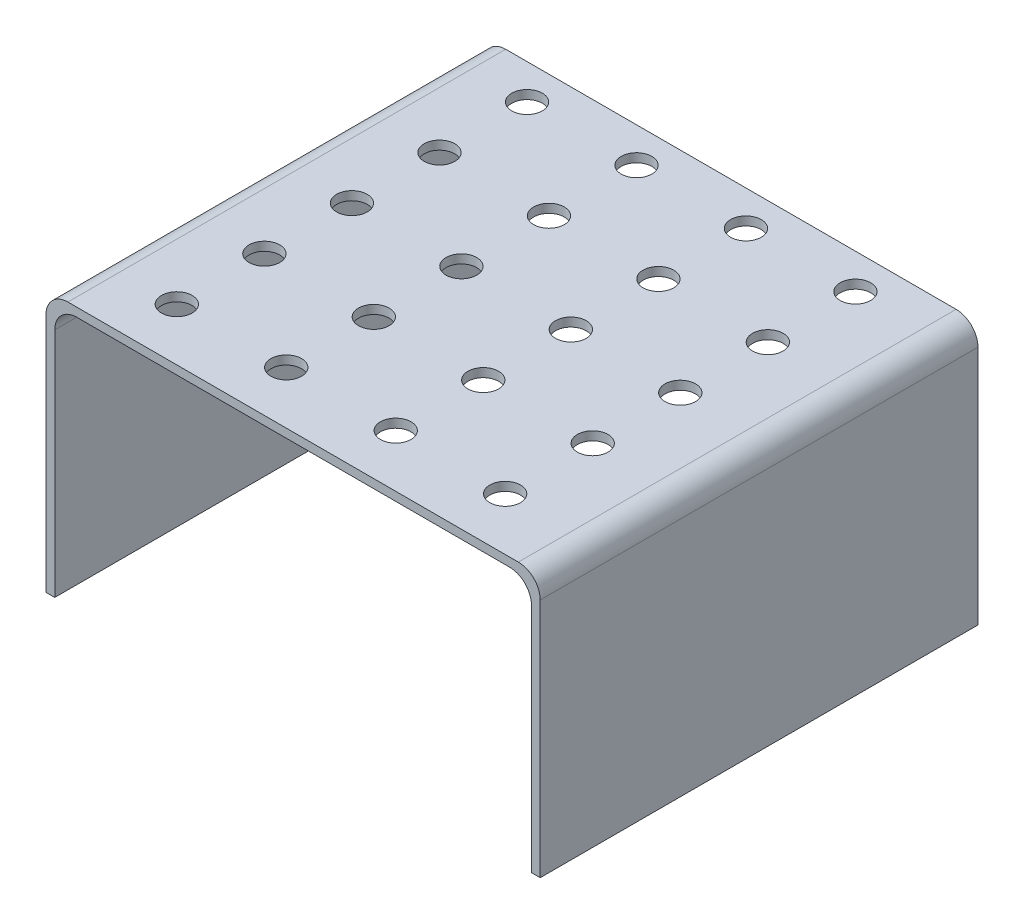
ISO-10303-21;
HEADER;
FILE_DESCRIPTION(('STEP AP214'),'2;1');
FILE_NAME('part.step','',(''),(''),'','','');
FILE_SCHEMA(('AUTOMOTIVE_DESIGN { 1 0 10303 214 1 1 1 1 }'));
ENDSEC;
DATA;
#1=APPLICATION_CONTEXT('core data for automotive mechanical design processes');
#2=APPLICATION_PROTOCOL_DEFINITION('international standard','automotive_design',2000,#1);
#3=PRODUCT_CONTEXT('',#1,'mechanical');
#4=PRODUCT('Part','Part','',(#3));
#5=PRODUCT_RELATED_PRODUCT_CATEGORY('part','',(#4));
#6=PRODUCT_DEFINITION_FORMATION('','',#4);
#7=PRODUCT_DEFINITION_CONTEXT('part definition',#1,'design');
#8=PRODUCT_DEFINITION('design','',#6,#7);
#9=PRODUCT_DEFINITION_SHAPE('','',#8);
#10=(LENGTH_UNIT() NAMED_UNIT(*) SI_UNIT(.MILLI.,.METRE.));
#11=(NAMED_UNIT(*) PLANE_ANGLE_UNIT() SI_UNIT($,.RADIAN.));
#12=(NAMED_UNIT(*) SI_UNIT($,.STERADIAN.) SOLID_ANGLE_UNIT());
#13=UNCERTAINTY_MEASURE_WITH_UNIT(LENGTH_MEASURE(1.E-05),#10,'distance_accuracy_value','');
#14=(GEOMETRIC_REPRESENTATION_CONTEXT(3) GLOBAL_UNCERTAINTY_ASSIGNED_CONTEXT((#13)) GLOBAL_UNIT_ASSIGNED_CONTEXT((#10,
#11,#12)) REPRESENTATION_CONTEXT('',''));
#15=CARTESIAN_POINT('',(0.,0.,0.));
#16=DIRECTION('',(0.,0.,1.));
#17=DIRECTION('',(1.,0.,0.));
#18=AXIS2_PLACEMENT_3D('',#15,#16,#17);
#19=CARTESIAN_POINT('',(-42.3555368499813,29.5386457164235,100.));
#20=DIRECTION('',(1.,0.,0.));
#21=DIRECTION('',(0.,0.,-1.));
#22=AXIS2_PLACEMENT_3D('',#19,#20,#21);
#23=PLANE('',#22);
#24=DIRECTION('',(0.,-1.,0.));
#25=VECTOR('',#24,1.);
#26=CARTESIAN_POINT('',(-42.3555368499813,29.5386457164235,100.));
#27=LINE('',#26,#25);
#28=CARTESIAN_POINT('',(-42.3555368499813,24.5386457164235,100.));
#29=VERTEX_POINT('',#28);
#30=CARTESIAN_POINT('',(-42.3555368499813,-30.4024130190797,100.));
#31=VERTEX_POINT('',#30);
#32=EDGE_CURVE('E417',#29,#31,#27,.T.);
#33=ORIENTED_EDGE('',*,*,#32,.F.);
#34=DIRECTION('',(0.,0.,-1.));
#35=VECTOR('',#34,1.);
#36=CARTESIAN_POINT('',(-42.3555368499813,24.5386457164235,100.));
#37=LINE('',#36,#35);
#38=CARTESIAN_POINT('',(-42.3555368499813,24.5386457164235,0.));
#39=VERTEX_POINT('',#38);
#40=EDGE_CURVE('E125',#29,#39,#37,.T.);
#41=ORIENTED_EDGE('',*,*,#40,.T.);
#42=DIRECTION('',(0.,-1.,0.));
#43=VECTOR('',#42,1.);
#44=CARTESIAN_POINT('',(-42.3555368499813,29.5386457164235,0.));
#45=LINE('',#44,#43);
#46=CARTESIAN_POINT('',(-42.3555368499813,-30.4024130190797,0.));
#47=VERTEX_POINT('',#46);
#48=EDGE_CURVE('E120',#39,#47,#45,.T.);
#49=ORIENTED_EDGE('',*,*,#48,.T.);
#50=DIRECTION('',(0.,0.,-1.));
#51=VECTOR('',#50,1.);
#52=CARTESIAN_POINT('',(-42.3555368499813,-30.4024130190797,100.));
#53=LINE('',#52,#51);
#54=EDGE_CURVE('E123',#31,#47,#53,.T.);
#55=ORIENTED_EDGE('',*,*,#54,.F.);
#56=EDGE_LOOP('',(#33,#41,#49,#55));
#57=FACE_BOUND('',#56,.T.);
#58=ADVANCED_FACE('F27',(#57),#23,.F.);
#59=CARTESIAN_POINT('',(-42.3555368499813,-30.4024130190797,100.));
#60=DIRECTION('',(0.,1.,0.));
#61=DIRECTION('',(0.,0.,1.));
#62=AXIS2_PLACEMENT_3D('',#59,#60,#61);
#63=PLANE('',#62);
#64=DIRECTION('',(1.,0.,0.));
#65=VECTOR('',#64,1.);
#66=CARTESIAN_POINT('',(-42.3555368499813,-30.4024130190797,0.));
#67=LINE('',#66,#65);
#68=CARTESIAN_POINT('',(-40.3555368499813,-30.4024130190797,0.));
#69=VERTEX_POINT('',#68);
#70=EDGE_CURVE('E127',#47,#69,#67,.T.);
#71=ORIENTED_EDGE('',*,*,#70,.T.);
#72=DIRECTION('',(0.,0.,-1.));
#73=VECTOR('',#72,1.);
#74=CARTESIAN_POINT('',(-40.3555368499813,-30.4024130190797,100.));
#75=LINE('',#74,#73);
#76=CARTESIAN_POINT('',(-40.3555368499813,-30.4024130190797,100.));
#77=VERTEX_POINT('',#76);
#78=EDGE_CURVE('E143',#77,#69,#75,.T.);
#79=ORIENTED_EDGE('',*,*,#78,.F.);
#80=DIRECTION('',(1.,0.,0.));
#81=VECTOR('',#80,1.);
#82=CARTESIAN_POINT('',(-42.3555368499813,-30.4024130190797,100.));
#83=LINE('',#82,#81);
#84=EDGE_CURVE('E141',#31,#77,#83,.T.);
#85=ORIENTED_EDGE('',*,*,#84,.F.);
#86=ORIENTED_EDGE('',*,*,#54,.T.);
#87=EDGE_LOOP('',(#71,#79,#85,#86));
#88=FACE_BOUND('',#87,.T.);
#89=ADVANCED_FACE('F140',(#88),#63,.F.);
#90=CARTESIAN_POINT('',(-40.3555368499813,-30.4024130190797,100.));
#91=DIRECTION('',(-1.,0.,0.));
#92=DIRECTION('',(0.,0.,1.));
#93=AXIS2_PLACEMENT_3D('',#90,#91,#92);
#94=PLANE('',#93);
#95=DIRECTION('',(0.,1.,0.));
#96=VECTOR('',#95,1.);
#97=CARTESIAN_POINT('',(-40.3555368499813,-30.4024130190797,0.));
#98=LINE('',#97,#96);
#99=CARTESIAN_POINT('',(-40.3555368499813,22.5386457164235,0.));
#100=VERTEX_POINT('',#99);
#101=EDGE_CURVE('E134',#69,#100,#98,.T.);
#102=ORIENTED_EDGE('',*,*,#101,.T.);
#103=DIRECTION('',(0.,0.,-1.));
#104=VECTOR('',#103,1.);
#105=CARTESIAN_POINT('',(-40.3555368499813,22.5386457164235,100.));
#106=LINE('',#105,#104);
#107=CARTESIAN_POINT('',(-40.3555368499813,22.5386457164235,100.));
#108=VERTEX_POINT('',#107);
#109=EDGE_CURVE('E156',#100,#108,#106,.F.);
#110=ORIENTED_EDGE('',*,*,#109,.T.);
#111=DIRECTION('',(0.,1.,0.));
#112=VECTOR('',#111,1.);
#113=CARTESIAN_POINT('',(-40.3555368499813,-30.4024130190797,100.));
#114=LINE('',#113,#112);
#115=EDGE_CURVE('E423',#77,#108,#114,.T.);
#116=ORIENTED_EDGE('',*,*,#115,.F.);
#117=ORIENTED_EDGE('',*,*,#78,.T.);
#118=EDGE_LOOP('',(#102,#110,#116,#117));
#119=FACE_BOUND('',#118,.T.);
#120=ADVANCED_FACE('F304',(#119),#94,.F.);
#121=CARTESIAN_POINT('',(-40.3555368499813,27.5386457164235,100.));
#122=DIRECTION('',(0.,1.,0.));
#123=DIRECTION('',(0.,0.,1.));
#124=AXIS2_PLACEMENT_3D('',#121,#122,#123);
#125=PLANE('',#124);
#126=CARTESIAN_POINT('',(25.5225589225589,27.5386457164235,88.));
#127=DIRECTION('',(0.,1.,0.));
#128=DIRECTION('',(0.,0.,1.));
#129=AXIS2_PLACEMENT_3D('',#126,#127,#128);
#130=CIRCLE('',#129,3.5);
#131=CARTESIAN_POINT('',(25.5225589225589,27.5386457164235,91.5));
#132=VERTEX_POINT('',#131);
#133=EDGE_CURVE('E570',#132,#132,#130,.T.);
#134=ORIENTED_EDGE('',*,*,#133,.T.);
#135=EDGE_LOOP('',(#134));
#136=FACE_BOUND('',#135,.T.);
#137=CARTESIAN_POINT('',(25.5225589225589,27.5386457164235,68.));
#138=DIRECTION('',(0.,1.,0.));
#139=DIRECTION('',(0.,0.,1.));
#140=AXIS2_PLACEMENT_3D('',#137,#138,#139);
#141=CIRCLE('',#140,3.5);
#142=CARTESIAN_POINT('',(25.5225589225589,27.5386457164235,71.5));
#143=VERTEX_POINT('',#142);
#144=EDGE_CURVE('E574',#143,#143,#141,.T.);
#145=ORIENTED_EDGE('',*,*,#144,.T.);
#146=EDGE_LOOP('',(#145));
#147=FACE_BOUND('',#146,.T.);
#148=CARTESIAN_POINT('',(50.5225589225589,27.5386457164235,88.));
#149=DIRECTION('',(0.,1.,0.));
#150=DIRECTION('',(0.,0.,1.));
#151=AXIS2_PLACEMENT_3D('',#148,#149,#150);
#152=CIRCLE('',#151,3.5);
#153=CARTESIAN_POINT('',(50.5225589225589,27.5386457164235,91.5));
#154=VERTEX_POINT('',#153);
#155=EDGE_CURVE('E128',#154,#154,#152,.T.);
#156=ORIENTED_EDGE('',*,*,#155,.T.);
#157=EDGE_LOOP('',(#156));
#158=FACE_BOUND('',#157,.T.);
#159=DIRECTION('',(1.,0.,0.));
#160=VECTOR('',#159,1.);
#161=CARTESIAN_POINT('',(-40.3555368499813,27.5386457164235,0.));
#162=LINE('',#161,#160);
#163=CARTESIAN_POINT('',(-35.3555368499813,27.5386457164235,0.));
#164=VERTEX_POINT('',#163);
#165=CARTESIAN_POINT('',(63.5225589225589,27.5386457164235,0.));
#166=VERTEX_POINT('',#165);
#167=EDGE_CURVE('E586',#164,#166,#162,.T.);
#168=ORIENTED_EDGE('',*,*,#167,.T.);
#169=DIRECTION('',(0.,0.,-1.));
#170=VECTOR('',#169,1.);
#171=CARTESIAN_POINT('',(63.5225589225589,27.5386457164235,100.));
#172=LINE('',#171,#170);
#173=CARTESIAN_POINT('',(63.5225589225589,27.5386457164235,100.));
#174=VERTEX_POINT('',#173);
#175=EDGE_CURVE('E154',#166,#174,#172,.F.);
#176=ORIENTED_EDGE('',*,*,#175,.T.);
#177=DIRECTION('',(1.,0.,0.));
#178=VECTOR('',#177,1.);
#179=CARTESIAN_POINT('',(-40.3555368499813,27.5386457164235,100.));
#180=LINE('',#179,#178);
#181=CARTESIAN_POINT('',(-35.3555368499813,27.5386457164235,100.));
#182=VERTEX_POINT('',#181);
#183=EDGE_CURVE('E426',#182,#174,#180,.T.);
#184=ORIENTED_EDGE('',*,*,#183,.F.);
#185=DIRECTION('',(0.,0.,-1.));
#186=VECTOR('',#185,1.);
#187=CARTESIAN_POINT('',(-35.3555368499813,27.5386457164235,0.));
#188=LINE('',#187,#186);
#189=EDGE_CURVE('E146',#182,#164,#188,.T.);
#190=ORIENTED_EDGE('',*,*,#189,.T.);
#191=EDGE_LOOP('',(#168,#176,#184,#190));
#192=FACE_BOUND('',#191,.T.);
#193=CARTESIAN_POINT('',(0.522558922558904,27.5386457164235,68.));
#194=DIRECTION('',(0.,1.,0.));
#195=DIRECTION('',(0.,0.,1.));
#196=AXIS2_PLACEMENT_3D('',#193,#194,#195);
#197=CIRCLE('',#196,3.5);
#198=CARTESIAN_POINT('',(0.522558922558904,27.5386457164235,71.5));
#199=VERTEX_POINT('',#198);
#200=EDGE_CURVE('E183',#199,#199,#197,.T.);
#201=ORIENTED_EDGE('',*,*,#200,.T.);
#202=EDGE_LOOP('',(#201));
#203=FACE_BOUND('',#202,.T.);
#204=CARTESIAN_POINT('',(25.5225589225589,27.5386457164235,48.));
#205=DIRECTION('',(0.,1.,0.));
#206=DIRECTION('',(0.,0.,1.));
#207=AXIS2_PLACEMENT_3D('',#204,#205,#206);
#208=CIRCLE('',#207,3.5);
#209=CARTESIAN_POINT('',(25.5225589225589,27.5386457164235,51.5));
#210=VERTEX_POINT('',#209);
#211=EDGE_CURVE('E189',#210,#210,#208,.T.);
#212=ORIENTED_EDGE('',*,*,#211,.T.);
#213=EDGE_LOOP('',(#212));
#214=FACE_BOUND('',#213,.T.);
#215=CARTESIAN_POINT('',(0.522558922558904,27.5386457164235,48.));
#216=DIRECTION('',(0.,1.,0.));
#217=DIRECTION('',(0.,0.,1.));
#218=AXIS2_PLACEMENT_3D('',#215,#216,#217);
#219=CIRCLE('',#218,3.5);
#220=CARTESIAN_POINT('',(0.522558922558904,27.5386457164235,51.5));
#221=VERTEX_POINT('',#220);
#222=EDGE_CURVE('E195',#221,#221,#219,.T.);
#223=ORIENTED_EDGE('',*,*,#222,.T.);
#224=EDGE_LOOP('',(#223));
#225=FACE_BOUND('',#224,.T.);
#226=CARTESIAN_POINT('',(25.5225589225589,27.5386457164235,28.));
#227=DIRECTION('',(0.,1.,0.));
#228=DIRECTION('',(0.,0.,1.));
#229=AXIS2_PLACEMENT_3D('',#226,#227,#228);
#230=CIRCLE('',#229,3.5);
#231=CARTESIAN_POINT('',(25.5225589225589,27.5386457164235,31.5));
#232=VERTEX_POINT('',#231);
#233=EDGE_CURVE('E201',#232,#232,#230,.T.);
#234=ORIENTED_EDGE('',*,*,#233,.T.);
#235=EDGE_LOOP('',(#234));
#236=FACE_BOUND('',#235,.T.);
#237=CARTESIAN_POINT('',(0.522558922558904,27.5386457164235,28.));
#238=DIRECTION('',(0.,1.,0.));
#239=DIRECTION('',(0.,0.,1.));
#240=AXIS2_PLACEMENT_3D('',#237,#238,#239);
#241=CIRCLE('',#240,3.5);
#242=CARTESIAN_POINT('',(0.522558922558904,27.5386457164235,31.5));
#243=VERTEX_POINT('',#242);
#244=EDGE_CURVE('E207',#243,#243,#241,.T.);
#245=ORIENTED_EDGE('',*,*,#244,.T.);
#246=EDGE_LOOP('',(#245));
#247=FACE_BOUND('',#246,.T.);
#248=CARTESIAN_POINT('',(0.522558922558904,27.5386457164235,88.));
#249=DIRECTION('',(0.,1.,0.));
#250=DIRECTION('',(0.,0.,1.));
#251=AXIS2_PLACEMENT_3D('',#248,#249,#250);
#252=CIRCLE('',#251,3.5);
#253=CARTESIAN_POINT('',(0.522558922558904,27.5386457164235,91.5));
#254=VERTEX_POINT('',#253);
#255=EDGE_CURVE('E213',#254,#254,#252,.T.);
#256=ORIENTED_EDGE('',*,*,#255,.T.);
#257=EDGE_LOOP('',(#256));
#258=FACE_BOUND('',#257,.T.);
#259=CARTESIAN_POINT('',(-24.4774410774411,27.5386457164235,88.));
#260=DIRECTION('',(0.,1.,0.));
#261=DIRECTION('',(0.,0.,1.));
#262=AXIS2_PLACEMENT_3D('',#259,#260,#261);
#263=CIRCLE('',#262,3.5);
#264=CARTESIAN_POINT('',(-24.4774410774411,27.5386457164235,91.5));
#265=VERTEX_POINT('',#264);
#266=EDGE_CURVE('E219',#265,#265,#263,.T.);
#267=ORIENTED_EDGE('',*,*,#266,.T.);
#268=EDGE_LOOP('',(#267));
#269=FACE_BOUND('',#268,.T.);
#270=CARTESIAN_POINT('',(50.5225589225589,27.5386457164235,68.));
#271=DIRECTION('',(0.,1.,0.));
#272=DIRECTION('',(0.,0.,1.));
#273=AXIS2_PLACEMENT_3D('',#270,#271,#272);
#274=CIRCLE('',#273,3.5);
#275=CARTESIAN_POINT('',(50.5225589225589,27.5386457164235,71.5));
#276=VERTEX_POINT('',#275);
#277=EDGE_CURVE('E225',#276,#276,#274,.T.);
#278=ORIENTED_EDGE('',*,*,#277,.T.);
#279=EDGE_LOOP('',(#278));
#280=FACE_BOUND('',#279,.T.);
#281=CARTESIAN_POINT('',(-24.4774410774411,27.5386457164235,68.));
#282=DIRECTION('',(0.,1.,0.));
#283=DIRECTION('',(0.,0.,1.));
#284=AXIS2_PLACEMENT_3D('',#281,#282,#283);
#285=CIRCLE('',#284,3.5);
#286=CARTESIAN_POINT('',(-24.4774410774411,27.5386457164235,71.5));
#287=VERTEX_POINT('',#286);
#288=EDGE_CURVE('E231',#287,#287,#285,.T.);
#289=ORIENTED_EDGE('',*,*,#288,.T.);
#290=EDGE_LOOP('',(#289));
#291=FACE_BOUND('',#290,.T.);
#292=CARTESIAN_POINT('',(50.5225589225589,27.5386457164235,48.));
#293=DIRECTION('',(0.,1.,0.));
#294=DIRECTION('',(0.,0.,1.));
#295=AXIS2_PLACEMENT_3D('',#292,#293,#294);
#296=CIRCLE('',#295,3.5);
#297=CARTESIAN_POINT('',(50.5225589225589,27.5386457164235,51.5));
#298=VERTEX_POINT('',#297);
#299=EDGE_CURVE('E237',#298,#298,#296,.T.);
#300=ORIENTED_EDGE('',*,*,#299,.T.);
#301=EDGE_LOOP('',(#300));
#302=FACE_BOUND('',#301,.T.);
#303=CARTESIAN_POINT('',(-24.4774410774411,27.5386457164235,48.));
#304=DIRECTION('',(0.,1.,0.));
#305=DIRECTION('',(0.,0.,1.));
#306=AXIS2_PLACEMENT_3D('',#303,#304,#305);
#307=CIRCLE('',#306,3.5);
#308=CARTESIAN_POINT('',(-24.4774410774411,27.5386457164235,51.5));
#309=VERTEX_POINT('',#308);
#310=EDGE_CURVE('E243',#309,#309,#307,.T.);
#311=ORIENTED_EDGE('',*,*,#310,.T.);
#312=EDGE_LOOP('',(#311));
#313=FACE_BOUND('',#312,.T.);
#314=CARTESIAN_POINT('',(50.5225589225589,27.5386457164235,28.));
#315=DIRECTION('',(0.,1.,0.));
#316=DIRECTION('',(0.,0.,1.));
#317=AXIS2_PLACEMENT_3D('',#314,#315,#316);
#318=CIRCLE('',#317,3.5);
#319=CARTESIAN_POINT('',(50.5225589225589,27.5386457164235,31.5));
#320=VERTEX_POINT('',#319);
#321=EDGE_CURVE('E249',#320,#320,#318,.T.);
#322=ORIENTED_EDGE('',*,*,#321,.T.);
#323=EDGE_LOOP('',(#322));
#324=FACE_BOUND('',#323,.T.);
#325=CARTESIAN_POINT('',(-24.4774410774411,27.5386457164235,28.));
#326=DIRECTION('',(0.,1.,0.));
#327=DIRECTION('',(0.,0.,1.));
#328=AXIS2_PLACEMENT_3D('',#325,#326,#327);
#329=CIRCLE('',#328,3.5);
#330=CARTESIAN_POINT('',(-24.4774410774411,27.5386457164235,31.5));
#331=VERTEX_POINT('',#330);
#332=EDGE_CURVE('E255',#331,#331,#329,.T.);
#333=ORIENTED_EDGE('',*,*,#332,.T.);
#334=EDGE_LOOP('',(#333));
#335=FACE_BOUND('',#334,.T.);
#336=CARTESIAN_POINT('',(50.5225589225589,27.5386457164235,8.00000000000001));
#337=DIRECTION('',(0.,1.,0.));
#338=DIRECTION('',(0.,0.,1.));
#339=AXIS2_PLACEMENT_3D('',#336,#337,#338);
#340=CIRCLE('',#339,3.5);
#341=CARTESIAN_POINT('',(50.5225589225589,27.5386457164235,11.5));
#342=VERTEX_POINT('',#341);
#343=EDGE_CURVE('E261',#342,#342,#340,.T.);
#344=ORIENTED_EDGE('',*,*,#343,.T.);
#345=EDGE_LOOP('',(#344));
#346=FACE_BOUND('',#345,.T.);
#347=CARTESIAN_POINT('',(25.5225589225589,27.5386457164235,8.00000000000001));
#348=DIRECTION('',(0.,1.,0.));
#349=DIRECTION('',(0.,0.,1.));
#350=AXIS2_PLACEMENT_3D('',#347,#348,#349);
#351=CIRCLE('',#350,3.5);
#352=CARTESIAN_POINT('',(25.5225589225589,27.5386457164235,11.5));
#353=VERTEX_POINT('',#352);
#354=EDGE_CURVE('E267',#353,#353,#351,.T.);
#355=ORIENTED_EDGE('',*,*,#354,.T.);
#356=EDGE_LOOP('',(#355));
#357=FACE_BOUND('',#356,.T.);
#358=CARTESIAN_POINT('',(0.522558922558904,27.5386457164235,8.00000000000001));
#359=DIRECTION('',(0.,1.,0.));
#360=DIRECTION('',(0.,0.,1.));
#361=AXIS2_PLACEMENT_3D('',#358,#359,#360);
#362=CIRCLE('',#361,3.5);
#363=CARTESIAN_POINT('',(0.522558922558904,27.5386457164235,11.5));
#364=VERTEX_POINT('',#363);
#365=EDGE_CURVE('E273',#364,#364,#362,.T.);
#366=ORIENTED_EDGE('',*,*,#365,.T.);
#367=EDGE_LOOP('',(#366));
#368=FACE_BOUND('',#367,.T.);
#369=CARTESIAN_POINT('',(-24.4774410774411,27.5386457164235,8.00000000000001));
#370=DIRECTION('',(0.,1.,0.));
#371=DIRECTION('',(0.,0.,1.));
#372=AXIS2_PLACEMENT_3D('',#369,#370,#371);
#373=CIRCLE('',#372,3.5);
#374=CARTESIAN_POINT('',(-24.4774410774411,27.5386457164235,11.5));
#375=VERTEX_POINT('',#374);
#376=EDGE_CURVE('E11',#375,#375,#373,.T.);
#377=ORIENTED_EDGE('',*,*,#376,.T.);
#378=EDGE_LOOP('',(#377));
#379=FACE_BOUND('',#378,.T.);
#380=ADVANCED_FACE('F379',(#136,#147,#158,#192,#203,#214,#225,#236,#247,#258,#269,#280,#291,
#302,#313,#324,#335,#346,#357,#368,#379),#125,.F.);
#381=CARTESIAN_POINT('',(68.5225589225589,27.5386457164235,100.));
#382=DIRECTION('',(1.,0.,0.));
#383=DIRECTION('',(0.,0.,-1.));
#384=AXIS2_PLACEMENT_3D('',#381,#382,#383);
#385=PLANE('',#384);
#386=DIRECTION('',(0.,-1.,0.));
#387=VECTOR('',#386,1.);
#388=CARTESIAN_POINT('',(68.5225589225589,27.5386457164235,100.));
#389=LINE('',#388,#387);
#390=CARTESIAN_POINT('',(68.5225589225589,22.5386457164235,100.));
#391=VERTEX_POINT('',#390);
#392=CARTESIAN_POINT('',(68.5225589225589,-30.4024130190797,100.));
#393=VERTEX_POINT('',#392);
#394=EDGE_CURVE('E429',#391,#393,#389,.T.);
#395=ORIENTED_EDGE('',*,*,#394,.F.);
#396=DIRECTION('',(0.,0.,-1.));
#397=VECTOR('',#396,1.);
#398=CARTESIAN_POINT('',(68.5225589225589,22.5386457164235,0.));
#399=LINE('',#398,#397);
#400=CARTESIAN_POINT('',(68.5225589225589,22.5386457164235,0.));
#401=VERTEX_POINT('',#400);
#402=EDGE_CURVE('E142',#391,#401,#399,.T.);
#403=ORIENTED_EDGE('',*,*,#402,.T.);
#404=DIRECTION('',(0.,-1.,0.));
#405=VECTOR('',#404,1.);
#406=CARTESIAN_POINT('',(68.5225589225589,27.5386457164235,0.));
#407=LINE('',#406,#405);
#408=CARTESIAN_POINT('',(68.5225589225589,-30.4024130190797,0.));
#409=VERTEX_POINT('',#408);
#410=EDGE_CURVE('E409',#401,#409,#407,.T.);
#411=ORIENTED_EDGE('',*,*,#410,.T.);
#412=DIRECTION('',(0.,0.,-1.));
#413=VECTOR('',#412,1.);
#414=CARTESIAN_POINT('',(68.5225589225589,-30.4024130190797,100.));
#415=LINE('',#414,#413);
#416=EDGE_CURVE('E148',#393,#409,#415,.T.);
#417=ORIENTED_EDGE('',*,*,#416,.F.);
#418=EDGE_LOOP('',(#395,#403,#411,#417));
#419=FACE_BOUND('',#418,.T.);
#420=ADVANCED_FACE('F381',(#419),#385,.F.);
#421=CARTESIAN_POINT('',(68.5225589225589,-30.4024130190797,100.));
#422=DIRECTION('',(0.,1.,0.));
#423=DIRECTION('',(0.,0.,1.));
#424=AXIS2_PLACEMENT_3D('',#421,#422,#423);
#425=PLANE('',#424);
#426=DIRECTION('',(1.,0.,0.));
#427=VECTOR('',#426,1.);
#428=CARTESIAN_POINT('',(68.5225589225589,-30.4024130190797,0.));
#429=LINE('',#428,#427);
#430=CARTESIAN_POINT('',(70.5225589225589,-30.4024130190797,0.));
#431=VERTEX_POINT('',#430);
#432=EDGE_CURVE('E401',#409,#431,#429,.T.);
#433=ORIENTED_EDGE('',*,*,#432,.T.);
#434=DIRECTION('',(0.,0.,-1.));
#435=VECTOR('',#434,1.);
#436=CARTESIAN_POINT('',(70.5225589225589,-30.4024130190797,100.));
#437=LINE('',#436,#435);
#438=CARTESIAN_POINT('',(70.5225589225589,-30.4024130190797,100.));
#439=VERTEX_POINT('',#438);
#440=EDGE_CURVE('E404',#439,#431,#437,.T.);
#441=ORIENTED_EDGE('',*,*,#440,.F.);
#442=DIRECTION('',(1.,0.,0.));
#443=VECTOR('',#442,1.);
#444=CARTESIAN_POINT('',(68.5225589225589,-30.4024130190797,100.));
#445=LINE('',#444,#443);
#446=EDGE_CURVE('E431',#393,#439,#445,.T.);
#447=ORIENTED_EDGE('',*,*,#446,.F.);
#448=ORIENTED_EDGE('',*,*,#416,.T.);
#449=EDGE_LOOP('',(#433,#441,#447,#448));
#450=FACE_BOUND('',#449,.T.);
#451=ADVANCED_FACE('F293',(#450),#425,.F.);
#452=CARTESIAN_POINT('',(70.5225589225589,-30.4024130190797,100.));
#453=DIRECTION('',(-1.,0.,0.));
#454=DIRECTION('',(0.,0.,1.));
#455=AXIS2_PLACEMENT_3D('',#452,#453,#454);
#456=PLANE('',#455);
#457=DIRECTION('',(0.,1.,0.));
#458=VECTOR('',#457,1.);
#459=CARTESIAN_POINT('',(70.5225589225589,-30.4024130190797,0.));
#460=LINE('',#459,#458);
#461=CARTESIAN_POINT('',(70.5225589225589,24.5386457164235,0.));
#462=VERTEX_POINT('',#461);
#463=EDGE_CURVE('E408',#431,#462,#460,.T.);
#464=ORIENTED_EDGE('',*,*,#463,.T.);
#465=DIRECTION('',(0.,0.,-1.));
#466=VECTOR('',#465,1.);
#467=CARTESIAN_POINT('',(70.5225589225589,24.5386457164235,100.));
#468=LINE('',#467,#466);
#469=CARTESIAN_POINT('',(70.5225589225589,24.5386457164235,100.));
#470=VERTEX_POINT('',#469);
#471=EDGE_CURVE('E50',#462,#470,#468,.F.);
#472=ORIENTED_EDGE('',*,*,#471,.T.);
#473=DIRECTION('',(0.,1.,0.));
#474=VECTOR('',#473,1.);
#475=CARTESIAN_POINT('',(70.5225589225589,-30.4024130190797,100.));
#476=LINE('',#475,#474);
#477=EDGE_CURVE('E411',#439,#470,#476,.T.);
#478=ORIENTED_EDGE('',*,*,#477,.F.);
#479=ORIENTED_EDGE('',*,*,#440,.T.);
#480=EDGE_LOOP('',(#464,#472,#478,#479));
#481=FACE_BOUND('',#480,.T.);
#482=ADVANCED_FACE('F283',(#481),#456,.F.);
#483=CARTESIAN_POINT('',(70.5225589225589,29.5386457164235,100.));
#484=DIRECTION('',(0.,-1.,0.));
#485=DIRECTION('',(1.,0.,0.));
#486=AXIS2_PLACEMENT_3D('',#483,#484,#485);
#487=PLANE('',#486);
#488=CARTESIAN_POINT('',(25.5225589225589,29.5386457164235,88.));
#489=DIRECTION('',(0.,1.,0.));
#490=DIRECTION('',(-1.,0.,0.));
#491=AXIS2_PLACEMENT_3D('',#488,#489,#490);
#492=CIRCLE('',#491,3.5);
#493=CARTESIAN_POINT('',(22.0225589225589,29.5386457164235,88.));
#494=VERTEX_POINT('',#493);
#495=EDGE_CURVE('E568',#494,#494,#492,.T.);
#496=ORIENTED_EDGE('',*,*,#495,.F.);
#497=EDGE_LOOP('',(#496));
#498=FACE_BOUND('',#497,.T.);
#499=CARTESIAN_POINT('',(25.5225589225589,29.5386457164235,68.));
#500=DIRECTION('',(0.,1.,0.));
#501=DIRECTION('',(-1.,0.,0.));
#502=AXIS2_PLACEMENT_3D('',#499,#500,#501);
#503=CIRCLE('',#502,3.5);
#504=CARTESIAN_POINT('',(22.0225589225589,29.5386457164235,68.));
#505=VERTEX_POINT('',#504);
#506=EDGE_CURVE('E571',#505,#505,#503,.T.);
#507=ORIENTED_EDGE('',*,*,#506,.F.);
#508=EDGE_LOOP('',(#507));
#509=FACE_BOUND('',#508,.T.);
#510=CARTESIAN_POINT('',(50.5225589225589,29.5386457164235,88.));
#511=DIRECTION('',(0.,1.,0.));
#512=DIRECTION('',(-1.,0.,0.));
#513=AXIS2_PLACEMENT_3D('',#510,#511,#512);
#514=CIRCLE('',#513,3.5);
#515=CARTESIAN_POINT('',(47.0225589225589,29.5386457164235,88.));
#516=VERTEX_POINT('',#515);
#517=EDGE_CURVE('E580',#516,#516,#514,.T.);
#518=ORIENTED_EDGE('',*,*,#517,.F.);
#519=EDGE_LOOP('',(#518));
#520=FACE_BOUND('',#519,.T.);
#521=DIRECTION('',(-1.,0.,0.));
#522=VECTOR('',#521,1.);
#523=CARTESIAN_POINT('',(70.5225589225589,29.5386457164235,100.));
#524=LINE('',#523,#522);
#525=CARTESIAN_POINT('',(65.5225589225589,29.5386457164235,100.));
#526=VERTEX_POINT('',#525);
#527=CARTESIAN_POINT('',(-37.3555368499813,29.5386457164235,100.));
#528=VERTEX_POINT('',#527);
#529=EDGE_CURVE('E412',#526,#528,#524,.T.);
#530=ORIENTED_EDGE('',*,*,#529,.F.);
#531=DIRECTION('',(0.,0.,-1.));
#532=VECTOR('',#531,1.);
#533=CARTESIAN_POINT('',(65.5225589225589,29.5386457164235,100.));
#534=LINE('',#533,#532);
#535=CARTESIAN_POINT('',(65.5225589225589,29.5386457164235,0.));
#536=VERTEX_POINT('',#535);
#537=EDGE_CURVE('E160',#526,#536,#534,.T.);
#538=ORIENTED_EDGE('',*,*,#537,.T.);
#539=DIRECTION('',(-1.,0.,0.));
#540=VECTOR('',#539,1.);
#541=CARTESIAN_POINT('',(70.5225589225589,29.5386457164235,0.));
#542=LINE('',#541,#540);
#543=CARTESIAN_POINT('',(-37.3555368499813,29.5386457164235,0.));
#544=VERTEX_POINT('',#543);
#545=EDGE_CURVE('E414',#536,#544,#542,.T.);
#546=ORIENTED_EDGE('',*,*,#545,.T.);
#547=DIRECTION('',(0.,0.,-1.));
#548=VECTOR('',#547,1.);
#549=CARTESIAN_POINT('',(-37.3555368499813,29.5386457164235,100.));
#550=LINE('',#549,#548);
#551=EDGE_CURVE('E158',#544,#528,#550,.F.);
#552=ORIENTED_EDGE('',*,*,#551,.T.);
#553=EDGE_LOOP('',(#530,#538,#546,#552));
#554=FACE_BOUND('',#553,.T.);
#555=CARTESIAN_POINT('',(0.522558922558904,29.5386457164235,68.));
#556=DIRECTION('',(0.,1.,0.));
#557=DIRECTION('',(-1.,0.,0.));
#558=AXIS2_PLACEMENT_3D('',#555,#556,#557);
#559=CIRCLE('',#558,3.5);
#560=CARTESIAN_POINT('',(-2.9774410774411,29.5386457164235,68.));
#561=VERTEX_POINT('',#560);
#562=EDGE_CURVE('E180',#561,#561,#559,.T.);
#563=ORIENTED_EDGE('',*,*,#562,.F.);
#564=EDGE_LOOP('',(#563));
#565=FACE_BOUND('',#564,.T.);
#566=CARTESIAN_POINT('',(25.5225589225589,29.5386457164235,48.));
#567=DIRECTION('',(0.,1.,0.));
#568=DIRECTION('',(-1.,0.,0.));
#569=AXIS2_PLACEMENT_3D('',#566,#567,#568);
#570=CIRCLE('',#569,3.5);
#571=CARTESIAN_POINT('',(22.0225589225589,29.5386457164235,48.));
#572=VERTEX_POINT('',#571);
#573=EDGE_CURVE('E186',#572,#572,#570,.T.);
#574=ORIENTED_EDGE('',*,*,#573,.F.);
#575=EDGE_LOOP('',(#574));
#576=FACE_BOUND('',#575,.T.);
#577=CARTESIAN_POINT('',(0.522558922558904,29.5386457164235,48.));
#578=DIRECTION('',(0.,1.,0.));
#579=DIRECTION('',(-1.,0.,0.));
#580=AXIS2_PLACEMENT_3D('',#577,#578,#579);
#581=CIRCLE('',#580,3.5);
#582=CARTESIAN_POINT('',(-2.9774410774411,29.5386457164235,48.));
#583=VERTEX_POINT('',#582);
#584=EDGE_CURVE('E192',#583,#583,#581,.T.);
#585=ORIENTED_EDGE('',*,*,#584,.F.);
#586=EDGE_LOOP('',(#585));
#587=FACE_BOUND('',#586,.T.);
#588=CARTESIAN_POINT('',(25.5225589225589,29.5386457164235,28.));
#589=DIRECTION('',(0.,1.,0.));
#590=DIRECTION('',(-1.,0.,0.));
#591=AXIS2_PLACEMENT_3D('',#588,#589,#590);
#592=CIRCLE('',#591,3.5);
#593=CARTESIAN_POINT('',(22.0225589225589,29.5386457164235,28.));
#594=VERTEX_POINT('',#593);
#595=EDGE_CURVE('E198',#594,#594,#592,.T.);
#596=ORIENTED_EDGE('',*,*,#595,.F.);
#597=EDGE_LOOP('',(#596));
#598=FACE_BOUND('',#597,.T.);
#599=CARTESIAN_POINT('',(0.522558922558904,29.5386457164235,28.));
#600=DIRECTION('',(0.,1.,0.));
#601=DIRECTION('',(-1.,0.,0.));
#602=AXIS2_PLACEMENT_3D('',#599,#600,#601);
#603=CIRCLE('',#602,3.5);
#604=CARTESIAN_POINT('',(-2.9774410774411,29.5386457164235,28.));
#605=VERTEX_POINT('',#604);
#606=EDGE_CURVE('E204',#605,#605,#603,.T.);
#607=ORIENTED_EDGE('',*,*,#606,.F.);
#608=EDGE_LOOP('',(#607));
#609=FACE_BOUND('',#608,.T.);
#610=CARTESIAN_POINT('',(0.522558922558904,29.5386457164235,88.));
#611=DIRECTION('',(0.,1.,0.));
#612=DIRECTION('',(-1.,0.,0.));
#613=AXIS2_PLACEMENT_3D('',#610,#611,#612);
#614=CIRCLE('',#613,3.5);
#615=CARTESIAN_POINT('',(-2.9774410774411,29.5386457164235,88.));
#616=VERTEX_POINT('',#615);
#617=EDGE_CURVE('E210',#616,#616,#614,.T.);
#618=ORIENTED_EDGE('',*,*,#617,.F.);
#619=EDGE_LOOP('',(#618));
#620=FACE_BOUND('',#619,.T.);
#621=CARTESIAN_POINT('',(-24.4774410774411,29.5386457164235,88.));
#622=DIRECTION('',(0.,1.,0.));
#623=DIRECTION('',(-1.,0.,0.));
#624=AXIS2_PLACEMENT_3D('',#621,#622,#623);
#625=CIRCLE('',#624,3.5);
#626=CARTESIAN_POINT('',(-27.9774410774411,29.5386457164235,88.));
#627=VERTEX_POINT('',#626);
#628=EDGE_CURVE('E216',#627,#627,#625,.T.);
#629=ORIENTED_EDGE('',*,*,#628,.F.);
#630=EDGE_LOOP('',(#629));
#631=FACE_BOUND('',#630,.T.);
#632=CARTESIAN_POINT('',(50.5225589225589,29.5386457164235,68.));
#633=DIRECTION('',(0.,1.,0.));
#634=DIRECTION('',(-1.,0.,0.));
#635=AXIS2_PLACEMENT_3D('',#632,#633,#634);
#636=CIRCLE('',#635,3.5);
#637=CARTESIAN_POINT('',(47.0225589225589,29.5386457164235,68.));
#638=VERTEX_POINT('',#637);
#639=EDGE_CURVE('E222',#638,#638,#636,.T.);
#640=ORIENTED_EDGE('',*,*,#639,.F.);
#641=EDGE_LOOP('',(#640));
#642=FACE_BOUND('',#641,.T.);
#643=CARTESIAN_POINT('',(-24.4774410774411,29.5386457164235,68.));
#644=DIRECTION('',(0.,1.,0.));
#645=DIRECTION('',(-1.,0.,0.));
#646=AXIS2_PLACEMENT_3D('',#643,#644,#645);
#647=CIRCLE('',#646,3.5);
#648=CARTESIAN_POINT('',(-27.9774410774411,29.5386457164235,68.));
#649=VERTEX_POINT('',#648);
#650=EDGE_CURVE('E228',#649,#649,#647,.T.);
#651=ORIENTED_EDGE('',*,*,#650,.F.);
#652=EDGE_LOOP('',(#651));
#653=FACE_BOUND('',#652,.T.);
#654=CARTESIAN_POINT('',(50.5225589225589,29.5386457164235,48.));
#655=DIRECTION('',(0.,1.,0.));
#656=DIRECTION('',(-1.,0.,0.));
#657=AXIS2_PLACEMENT_3D('',#654,#655,#656);
#658=CIRCLE('',#657,3.5);
#659=CARTESIAN_POINT('',(47.0225589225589,29.5386457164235,48.));
#660=VERTEX_POINT('',#659);
#661=EDGE_CURVE('E234',#660,#660,#658,.T.);
#662=ORIENTED_EDGE('',*,*,#661,.F.);
#663=EDGE_LOOP('',(#662));
#664=FACE_BOUND('',#663,.T.);
#665=CARTESIAN_POINT('',(-24.4774410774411,29.5386457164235,48.));
#666=DIRECTION('',(0.,1.,0.));
#667=DIRECTION('',(-1.,0.,0.));
#668=AXIS2_PLACEMENT_3D('',#665,#666,#667);
#669=CIRCLE('',#668,3.5);
#670=CARTESIAN_POINT('',(-27.9774410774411,29.5386457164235,48.));
#671=VERTEX_POINT('',#670);
#672=EDGE_CURVE('E240',#671,#671,#669,.T.);
#673=ORIENTED_EDGE('',*,*,#672,.F.);
#674=EDGE_LOOP('',(#673));
#675=FACE_BOUND('',#674,.T.);
#676=CARTESIAN_POINT('',(50.5225589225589,29.5386457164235,28.));
#677=DIRECTION('',(0.,1.,0.));
#678=DIRECTION('',(-1.,0.,0.));
#679=AXIS2_PLACEMENT_3D('',#676,#677,#678);
#680=CIRCLE('',#679,3.5);
#681=CARTESIAN_POINT('',(47.0225589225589,29.5386457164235,28.));
#682=VERTEX_POINT('',#681);
#683=EDGE_CURVE('E246',#682,#682,#680,.T.);
#684=ORIENTED_EDGE('',*,*,#683,.F.);
#685=EDGE_LOOP('',(#684));
#686=FACE_BOUND('',#685,.T.);
#687=CARTESIAN_POINT('',(-24.4774410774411,29.5386457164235,28.));
#688=DIRECTION('',(0.,1.,0.));
#689=DIRECTION('',(-1.,0.,0.));
#690=AXIS2_PLACEMENT_3D('',#687,#688,#689);
#691=CIRCLE('',#690,3.5);
#692=CARTESIAN_POINT('',(-27.9774410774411,29.5386457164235,28.));
#693=VERTEX_POINT('',#692);
#694=EDGE_CURVE('E252',#693,#693,#691,.T.);
#695=ORIENTED_EDGE('',*,*,#694,.F.);
#696=EDGE_LOOP('',(#695));
#697=FACE_BOUND('',#696,.T.);
#698=CARTESIAN_POINT('',(50.5225589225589,29.5386457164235,8.00000000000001));
#699=DIRECTION('',(0.,1.,0.));
#700=DIRECTION('',(-1.,0.,0.));
#701=AXIS2_PLACEMENT_3D('',#698,#699,#700);
#702=CIRCLE('',#701,3.5);
#703=CARTESIAN_POINT('',(47.0225589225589,29.5386457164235,8.00000000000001));
#704=VERTEX_POINT('',#703);
#705=EDGE_CURVE('E258',#704,#704,#702,.T.);
#706=ORIENTED_EDGE('',*,*,#705,.F.);
#707=EDGE_LOOP('',(#706));
#708=FACE_BOUND('',#707,.T.);
#709=CARTESIAN_POINT('',(25.5225589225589,29.5386457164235,8.00000000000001));
#710=DIRECTION('',(0.,1.,0.));
#711=DIRECTION('',(-1.,0.,0.));
#712=AXIS2_PLACEMENT_3D('',#709,#710,#711);
#713=CIRCLE('',#712,3.5);
#714=CARTESIAN_POINT('',(22.0225589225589,29.5386457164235,8.00000000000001));
#715=VERTEX_POINT('',#714);
#716=EDGE_CURVE('E264',#715,#715,#713,.T.);
#717=ORIENTED_EDGE('',*,*,#716,.F.);
#718=EDGE_LOOP('',(#717));
#719=FACE_BOUND('',#718,.T.);
#720=CARTESIAN_POINT('',(0.522558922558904,29.5386457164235,8.00000000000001));
#721=DIRECTION('',(0.,1.,0.));
#722=DIRECTION('',(-1.,0.,0.));
#723=AXIS2_PLACEMENT_3D('',#720,#721,#722);
#724=CIRCLE('',#723,3.5);
#725=CARTESIAN_POINT('',(-2.9774410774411,29.5386457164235,8.00000000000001));
#726=VERTEX_POINT('',#725);
#727=EDGE_CURVE('E270',#726,#726,#724,.T.);
#728=ORIENTED_EDGE('',*,*,#727,.F.);
#729=EDGE_LOOP('',(#728));
#730=FACE_BOUND('',#729,.T.);
#731=CARTESIAN_POINT('',(-24.4774410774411,29.5386457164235,8.00000000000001));
#732=DIRECTION('',(0.,1.,0.));
#733=DIRECTION('',(-1.,0.,0.));
#734=AXIS2_PLACEMENT_3D('',#731,#732,#733);
#735=CIRCLE('',#734,3.5);
#736=CARTESIAN_POINT('',(-27.9774410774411,29.5386457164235,8.00000000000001));
#737=VERTEX_POINT('',#736);
#738=EDGE_CURVE('E35',#737,#737,#735,.T.);
#739=ORIENTED_EDGE('',*,*,#738,.F.);
#740=EDGE_LOOP('',(#739));
#741=FACE_BOUND('',#740,.T.);
#742=ADVANCED_FACE('F280',(#498,#509,#520,#554,#565,#576,#587,#598,#609,#620,#631,#642,#653,
#664,#675,#686,#697,#708,#719,#730,#741),#487,.F.);
#743=CARTESIAN_POINT('',(-42.3555368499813,-30.4024130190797,100.));
#744=DIRECTION('',(0.,0.,1.));
#745=DIRECTION('',(1.,0.,0.));
#746=AXIS2_PLACEMENT_3D('',#743,#744,#745);
#747=PLANE('',#746);
#748=ORIENTED_EDGE('',*,*,#477,.T.);
#749=CARTESIAN_POINT('',(65.5225589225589,24.5386457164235,100.));
#750=DIRECTION('',(0.,0.,1.));
#751=DIRECTION('',(1.,0.,0.));
#752=AXIS2_PLACEMENT_3D('',#749,#750,#751);
#753=CIRCLE('',#752,5.);
#754=EDGE_CURVE('E169',#470,#526,#753,.T.);
#755=ORIENTED_EDGE('',*,*,#754,.T.);
#756=ORIENTED_EDGE('',*,*,#529,.T.);
#757=CARTESIAN_POINT('',(-37.3555368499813,24.5386457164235,100.));
#758=DIRECTION('',(0.,0.,1.));
#759=DIRECTION('',(1.,0.,0.));
#760=AXIS2_PLACEMENT_3D('',#757,#758,#759);
#761=CIRCLE('',#760,5.);
#762=EDGE_CURVE('E42',#528,#29,#761,.T.);
#763=ORIENTED_EDGE('',*,*,#762,.T.);
#764=ORIENTED_EDGE('',*,*,#32,.T.);
#765=ORIENTED_EDGE('',*,*,#84,.T.);
#766=ORIENTED_EDGE('',*,*,#115,.T.);
#767=CARTESIAN_POINT('',(-35.3555368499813,22.5386457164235,100.));
#768=DIRECTION('',(0.,0.,1.));
#769=DIRECTION('',(1.,0.,0.));
#770=AXIS2_PLACEMENT_3D('',#767,#768,#769);
#771=CIRCLE('',#770,5.);
#772=EDGE_CURVE('E178',#108,#182,#771,.F.);
#773=ORIENTED_EDGE('',*,*,#772,.T.);
#774=ORIENTED_EDGE('',*,*,#183,.T.);
#775=CARTESIAN_POINT('',(63.5225589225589,22.5386457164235,100.));
#776=DIRECTION('',(0.,0.,1.));
#777=DIRECTION('',(1.,0.,0.));
#778=AXIS2_PLACEMENT_3D('',#775,#776,#777);
#779=CIRCLE('',#778,5.);
#780=EDGE_CURVE('E174',#174,#391,#779,.F.);
#781=ORIENTED_EDGE('',*,*,#780,.T.);
#782=ORIENTED_EDGE('',*,*,#394,.T.);
#783=ORIENTED_EDGE('',*,*,#446,.T.);
#784=EDGE_LOOP('',(#748,#755,#756,#763,#764,#765,#766,#773,#774,#781,#782,#783));
#785=FACE_BOUND('',#784,.T.);
#786=ADVANCED_FACE('F282',(#785),#747,.T.);
#787=CARTESIAN_POINT('',(-42.3555368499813,-30.4024130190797,0.));
#788=DIRECTION('',(0.,0.,1.));
#789=DIRECTION('',(1.,0.,0.));
#790=AXIS2_PLACEMENT_3D('',#787,#788,#789);
#791=PLANE('',#790);
#792=ORIENTED_EDGE('',*,*,#545,.F.);
#793=CARTESIAN_POINT('',(65.5225589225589,24.5386457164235,0.));
#794=DIRECTION('',(0.,0.,1.));
#795=DIRECTION('',(1.,0.,0.));
#796=AXIS2_PLACEMENT_3D('',#793,#794,#795);
#797=CIRCLE('',#796,5.);
#798=EDGE_CURVE('E165',#536,#462,#797,.F.);
#799=ORIENTED_EDGE('',*,*,#798,.T.);
#800=ORIENTED_EDGE('',*,*,#463,.F.);
#801=ORIENTED_EDGE('',*,*,#432,.F.);
#802=ORIENTED_EDGE('',*,*,#410,.F.);
#803=CARTESIAN_POINT('',(63.5225589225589,22.5386457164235,0.));
#804=DIRECTION('',(0.,0.,1.));
#805=DIRECTION('',(1.,0.,0.));
#806=AXIS2_PLACEMENT_3D('',#803,#804,#805);
#807=CIRCLE('',#806,5.);
#808=EDGE_CURVE('E172',#401,#166,#807,.T.);
#809=ORIENTED_EDGE('',*,*,#808,.T.);
#810=ORIENTED_EDGE('',*,*,#167,.F.);
#811=CARTESIAN_POINT('',(-35.3555368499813,22.5386457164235,0.));
#812=DIRECTION('',(0.,0.,1.));
#813=DIRECTION('',(1.,0.,0.));
#814=AXIS2_PLACEMENT_3D('',#811,#812,#813);
#815=CIRCLE('',#814,5.);
#816=EDGE_CURVE('E176',#164,#100,#815,.T.);
#817=ORIENTED_EDGE('',*,*,#816,.T.);
#818=ORIENTED_EDGE('',*,*,#101,.F.);
#819=ORIENTED_EDGE('',*,*,#70,.F.);
#820=ORIENTED_EDGE('',*,*,#48,.F.);
#821=CARTESIAN_POINT('',(-37.3555368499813,24.5386457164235,0.));
#822=DIRECTION('',(0.,0.,1.));
#823=DIRECTION('',(1.,0.,0.));
#824=AXIS2_PLACEMENT_3D('',#821,#822,#823);
#825=CIRCLE('',#824,5.);
#826=EDGE_CURVE('E163',#39,#544,#825,.F.);
#827=ORIENTED_EDGE('',*,*,#826,.T.);
#828=EDGE_LOOP('',(#792,#799,#800,#801,#802,#809,#810,#817,#818,#819,#820,#827));
#829=FACE_BOUND('',#828,.T.);
#830=ADVANCED_FACE('F132',(#829),#791,.F.);
#831=CARTESIAN_POINT('',(63.5225589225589,22.5386457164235,100.));
#832=DIRECTION('',(0.,0.,1.));
#833=DIRECTION('',(1.,0.,0.));
#834=AXIS2_PLACEMENT_3D('',#831,#832,#833);
#835=CYLINDRICAL_SURFACE('',#834,5.);
#836=ORIENTED_EDGE('',*,*,#780,.F.);
#837=ORIENTED_EDGE('',*,*,#175,.F.);
#838=ORIENTED_EDGE('',*,*,#808,.F.);
#839=ORIENTED_EDGE('',*,*,#402,.F.);
#840=EDGE_LOOP('',(#836,#837,#838,#839));
#841=FACE_BOUND('',#840,.T.);
#842=ADVANCED_FACE('F453',(#841),#835,.F.);
#843=CARTESIAN_POINT('',(-35.3555368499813,22.5386457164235,100.));
#844=DIRECTION('',(0.,0.,1.));
#845=DIRECTION('',(1.,0.,0.));
#846=AXIS2_PLACEMENT_3D('',#843,#844,#845);
#847=CYLINDRICAL_SURFACE('',#846,5.);
#848=ORIENTED_EDGE('',*,*,#772,.F.);
#849=ORIENTED_EDGE('',*,*,#109,.F.);
#850=ORIENTED_EDGE('',*,*,#816,.F.);
#851=ORIENTED_EDGE('',*,*,#189,.F.);
#852=EDGE_LOOP('',(#848,#849,#850,#851));
#853=FACE_BOUND('',#852,.T.);
#854=ADVANCED_FACE('F445',(#853),#847,.F.);
#855=CARTESIAN_POINT('',(65.5225589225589,24.5386457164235,100.));
#856=DIRECTION('',(0.,0.,-1.));
#857=DIRECTION('',(-1.,0.,0.));
#858=AXIS2_PLACEMENT_3D('',#855,#856,#857);
#859=CYLINDRICAL_SURFACE('',#858,5.);
#860=ORIENTED_EDGE('',*,*,#754,.F.);
#861=ORIENTED_EDGE('',*,*,#471,.F.);
#862=ORIENTED_EDGE('',*,*,#798,.F.);
#863=ORIENTED_EDGE('',*,*,#537,.F.);
#864=EDGE_LOOP('',(#860,#861,#862,#863));
#865=FACE_BOUND('',#864,.T.);
#866=ADVANCED_FACE('F443',(#865),#859,.T.);
#867=CARTESIAN_POINT('',(-37.3555368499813,24.5386457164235,100.));
#868=DIRECTION('',(0.,0.,-1.));
#869=DIRECTION('',(-1.,0.,0.));
#870=AXIS2_PLACEMENT_3D('',#867,#868,#869);
#871=CYLINDRICAL_SURFACE('',#870,5.);
#872=ORIENTED_EDGE('',*,*,#762,.F.);
#873=ORIENTED_EDGE('',*,*,#551,.F.);
#874=ORIENTED_EDGE('',*,*,#826,.F.);
#875=ORIENTED_EDGE('',*,*,#40,.F.);
#876=EDGE_LOOP('',(#872,#873,#874,#875));
#877=FACE_BOUND('',#876,.T.);
#878=ADVANCED_FACE('F440',(#877),#871,.T.);
#879=CARTESIAN_POINT('',(50.5225589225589,-30.4024130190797,88.));
#880=DIRECTION('',(0.,1.,0.));
#881=DIRECTION('',(-1.,0.,0.));
#882=AXIS2_PLACEMENT_3D('',#879,#880,#881);
#883=CYLINDRICAL_SURFACE('',#882,3.5);
#884=ORIENTED_EDGE('',*,*,#517,.T.);
#885=EDGE_LOOP('',(#884));
#886=FACE_BOUND('',#885,.T.);
#887=ORIENTED_EDGE('',*,*,#155,.F.);
#888=EDGE_LOOP('',(#887));
#889=FACE_BOUND('',#888,.T.);
#890=ADVANCED_FACE('F451',(#886,#889),#883,.F.);
#891=CARTESIAN_POINT('',(25.5225589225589,-30.4024130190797,68.));
#892=DIRECTION('',(0.,1.,0.));
#893=DIRECTION('',(-1.,0.,0.));
#894=AXIS2_PLACEMENT_3D('',#891,#892,#893);
#895=CYLINDRICAL_SURFACE('',#894,3.5);
#896=ORIENTED_EDGE('',*,*,#506,.T.);
#897=EDGE_LOOP('',(#896));
#898=FACE_BOUND('',#897,.T.);
#899=ORIENTED_EDGE('',*,*,#144,.F.);
#900=EDGE_LOOP('',(#899));
#901=FACE_BOUND('',#900,.T.);
#902=ADVANCED_FACE('F312',(#898,#901),#895,.F.);
#903=CARTESIAN_POINT('',(0.522558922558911,-30.4024130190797,68.));
#904=DIRECTION('',(0.,1.,0.));
#905=DIRECTION('',(-1.,0.,0.));
#906=AXIS2_PLACEMENT_3D('',#903,#904,#905);
#907=CYLINDRICAL_SURFACE('',#906,3.5);
#908=ORIENTED_EDGE('',*,*,#562,.T.);
#909=EDGE_LOOP('',(#908));
#910=FACE_BOUND('',#909,.T.);
#911=ORIENTED_EDGE('',*,*,#200,.F.);
#912=EDGE_LOOP('',(#911));
#913=FACE_BOUND('',#912,.T.);
#914=ADVANCED_FACE('F308',(#910,#913),#907,.F.);
#915=CARTESIAN_POINT('',(25.5225589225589,-30.4024130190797,48.));
#916=DIRECTION('',(0.,1.,0.));
#917=DIRECTION('',(-1.,0.,0.));
#918=AXIS2_PLACEMENT_3D('',#915,#916,#917);
#919=CYLINDRICAL_SURFACE('',#918,3.5);
#920=ORIENTED_EDGE('',*,*,#573,.T.);
#921=EDGE_LOOP('',(#920));
#922=FACE_BOUND('',#921,.T.);
#923=ORIENTED_EDGE('',*,*,#211,.F.);
#924=EDGE_LOOP('',(#923));
#925=FACE_BOUND('',#924,.T.);
#926=ADVANCED_FACE('F311',(#922,#925),#919,.F.);
#927=CARTESIAN_POINT('',(0.522558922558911,-30.4024130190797,48.));
#928=DIRECTION('',(0.,1.,0.));
#929=DIRECTION('',(-1.,0.,0.));
#930=AXIS2_PLACEMENT_3D('',#927,#928,#929);
#931=CYLINDRICAL_SURFACE('',#930,3.5);
#932=ORIENTED_EDGE('',*,*,#584,.T.);
#933=EDGE_LOOP('',(#932));
#934=FACE_BOUND('',#933,.T.);
#935=ORIENTED_EDGE('',*,*,#222,.F.);
#936=EDGE_LOOP('',(#935));
#937=FACE_BOUND('',#936,.T.);
#938=ADVANCED_FACE('F316',(#934,#937),#931,.F.);
#939=CARTESIAN_POINT('',(25.5225589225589,-30.4024130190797,28.));
#940=DIRECTION('',(0.,1.,0.));
#941=DIRECTION('',(-1.,0.,0.));
#942=AXIS2_PLACEMENT_3D('',#939,#940,#941);
#943=CYLINDRICAL_SURFACE('',#942,3.5);
#944=ORIENTED_EDGE('',*,*,#595,.T.);
#945=EDGE_LOOP('',(#944));
#946=FACE_BOUND('',#945,.T.);
#947=ORIENTED_EDGE('',*,*,#233,.F.);
#948=EDGE_LOOP('',(#947));
#949=FACE_BOUND('',#948,.T.);
#950=ADVANCED_FACE('F320',(#946,#949),#943,.F.);
#951=CARTESIAN_POINT('',(0.522558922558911,-30.4024130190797,28.));
#952=DIRECTION('',(0.,1.,0.));
#953=DIRECTION('',(-1.,0.,0.));
#954=AXIS2_PLACEMENT_3D('',#951,#952,#953);
#955=CYLINDRICAL_SURFACE('',#954,3.5);
#956=ORIENTED_EDGE('',*,*,#606,.T.);
#957=EDGE_LOOP('',(#956));
#958=FACE_BOUND('',#957,.T.);
#959=ORIENTED_EDGE('',*,*,#244,.F.);
#960=EDGE_LOOP('',(#959));
#961=FACE_BOUND('',#960,.T.);
#962=ADVANCED_FACE('F324',(#958,#961),#955,.F.);
#963=CARTESIAN_POINT('',(25.5225589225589,-30.4024130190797,88.));
#964=DIRECTION('',(0.,1.,0.));
#965=DIRECTION('',(-1.,0.,0.));
#966=AXIS2_PLACEMENT_3D('',#963,#964,#965);
#967=CYLINDRICAL_SURFACE('',#966,3.5);
#968=ORIENTED_EDGE('',*,*,#495,.T.);
#969=EDGE_LOOP('',(#968));
#970=FACE_BOUND('',#969,.T.);
#971=ORIENTED_EDGE('',*,*,#133,.F.);
#972=EDGE_LOOP('',(#971));
#973=FACE_BOUND('',#972,.T.);
#974=ADVANCED_FACE('F328',(#970,#973),#967,.F.);
#975=CARTESIAN_POINT('',(0.522558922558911,-30.4024130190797,88.));
#976=DIRECTION('',(0.,1.,0.));
#977=DIRECTION('',(-1.,0.,0.));
#978=AXIS2_PLACEMENT_3D('',#975,#976,#977);
#979=CYLINDRICAL_SURFACE('',#978,3.5);
#980=ORIENTED_EDGE('',*,*,#617,.T.);
#981=EDGE_LOOP('',(#980));
#982=FACE_BOUND('',#981,.T.);
#983=ORIENTED_EDGE('',*,*,#255,.F.);
#984=EDGE_LOOP('',(#983));
#985=FACE_BOUND('',#984,.T.);
#986=ADVANCED_FACE('F330',(#982,#985),#979,.F.);
#987=CARTESIAN_POINT('',(-24.4774410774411,-30.4024130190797,88.));
#988=DIRECTION('',(0.,1.,0.));
#989=DIRECTION('',(-1.,0.,0.));
#990=AXIS2_PLACEMENT_3D('',#987,#988,#989);
#991=CYLINDRICAL_SURFACE('',#990,3.5);
#992=ORIENTED_EDGE('',*,*,#628,.T.);
#993=EDGE_LOOP('',(#992));
#994=FACE_BOUND('',#993,.T.);
#995=ORIENTED_EDGE('',*,*,#266,.F.);
#996=EDGE_LOOP('',(#995));
#997=FACE_BOUND('',#996,.T.);
#998=ADVANCED_FACE('F333',(#994,#997),#991,.F.);
#999=CARTESIAN_POINT('',(50.5225589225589,-30.4024130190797,68.));
#1000=DIRECTION('',(0.,1.,0.));
#1001=DIRECTION('',(-1.,0.,0.));
#1002=AXIS2_PLACEMENT_3D('',#999,#1000,#1001);
#1003=CYLINDRICAL_SURFACE('',#1002,3.5);
#1004=ORIENTED_EDGE('',*,*,#639,.T.);
#1005=EDGE_LOOP('',(#1004));
#1006=FACE_BOUND('',#1005,.T.);
#1007=ORIENTED_EDGE('',*,*,#277,.F.);
#1008=EDGE_LOOP('',(#1007));
#1009=FACE_BOUND('',#1008,.T.);
#1010=ADVANCED_FACE('F337',(#1006,#1009),#1003,.F.);
#1011=CARTESIAN_POINT('',(-24.4774410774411,-30.4024130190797,68.));
#1012=DIRECTION('',(0.,1.,0.));
#1013=DIRECTION('',(-1.,0.,0.));
#1014=AXIS2_PLACEMENT_3D('',#1011,#1012,#1013);
#1015=CYLINDRICAL_SURFACE('',#1014,3.5);
#1016=ORIENTED_EDGE('',*,*,#650,.T.);
#1017=EDGE_LOOP('',(#1016));
#1018=FACE_BOUND('',#1017,.T.);
#1019=ORIENTED_EDGE('',*,*,#288,.F.);
#1020=EDGE_LOOP('',(#1019));
#1021=FACE_BOUND('',#1020,.T.);
#1022=ADVANCED_FACE('F341',(#1018,#1021),#1015,.F.);
#1023=CARTESIAN_POINT('',(50.5225589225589,-30.4024130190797,48.));
#1024=DIRECTION('',(0.,1.,0.));
#1025=DIRECTION('',(-1.,0.,0.));
#1026=AXIS2_PLACEMENT_3D('',#1023,#1024,#1025);
#1027=CYLINDRICAL_SURFACE('',#1026,3.5);
#1028=ORIENTED_EDGE('',*,*,#661,.T.);
#1029=EDGE_LOOP('',(#1028));
#1030=FACE_BOUND('',#1029,.T.);
#1031=ORIENTED_EDGE('',*,*,#299,.F.);
#1032=EDGE_LOOP('',(#1031));
#1033=FACE_BOUND('',#1032,.T.);
#1034=ADVANCED_FACE('F345',(#1030,#1033),#1027,.F.);
#1035=CARTESIAN_POINT('',(-24.4774410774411,-30.4024130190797,48.));
#1036=DIRECTION('',(0.,1.,0.));
#1037=DIRECTION('',(-1.,0.,0.));
#1038=AXIS2_PLACEMENT_3D('',#1035,#1036,#1037);
#1039=CYLINDRICAL_SURFACE('',#1038,3.5);
#1040=ORIENTED_EDGE('',*,*,#672,.T.);
#1041=EDGE_LOOP('',(#1040));
#1042=FACE_BOUND('',#1041,.T.);
#1043=ORIENTED_EDGE('',*,*,#310,.F.);
#1044=EDGE_LOOP('',(#1043));
#1045=FACE_BOUND('',#1044,.T.);
#1046=ADVANCED_FACE('F349',(#1042,#1045),#1039,.F.);
#1047=CARTESIAN_POINT('',(50.5225589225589,-30.4024130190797,28.));
#1048=DIRECTION('',(0.,1.,0.));
#1049=DIRECTION('',(-1.,0.,0.));
#1050=AXIS2_PLACEMENT_3D('',#1047,#1048,#1049);
#1051=CYLINDRICAL_SURFACE('',#1050,3.5);
#1052=ORIENTED_EDGE('',*,*,#683,.T.);
#1053=EDGE_LOOP('',(#1052));
#1054=FACE_BOUND('',#1053,.T.);
#1055=ORIENTED_EDGE('',*,*,#321,.F.);
#1056=EDGE_LOOP('',(#1055));
#1057=FACE_BOUND('',#1056,.T.);
#1058=ADVANCED_FACE('F353',(#1054,#1057),#1051,.F.);
#1059=CARTESIAN_POINT('',(-24.4774410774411,-30.4024130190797,28.));
#1060=DIRECTION('',(0.,1.,0.));
#1061=DIRECTION('',(-1.,0.,0.));
#1062=AXIS2_PLACEMENT_3D('',#1059,#1060,#1061);
#1063=CYLINDRICAL_SURFACE('',#1062,3.5);
#1064=ORIENTED_EDGE('',*,*,#694,.T.);
#1065=EDGE_LOOP('',(#1064));
#1066=FACE_BOUND('',#1065,.T.);
#1067=ORIENTED_EDGE('',*,*,#332,.F.);
#1068=EDGE_LOOP('',(#1067));
#1069=FACE_BOUND('',#1068,.T.);
#1070=ADVANCED_FACE('F357',(#1066,#1069),#1063,.F.);
#1071=CARTESIAN_POINT('',(50.5225589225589,-30.4024130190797,8.00000000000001));
#1072=DIRECTION('',(0.,1.,0.));
#1073=DIRECTION('',(-1.,0.,0.));
#1074=AXIS2_PLACEMENT_3D('',#1071,#1072,#1073);
#1075=CYLINDRICAL_SURFACE('',#1074,3.5);
#1076=ORIENTED_EDGE('',*,*,#705,.T.);
#1077=EDGE_LOOP('',(#1076));
#1078=FACE_BOUND('',#1077,.T.);
#1079=ORIENTED_EDGE('',*,*,#343,.F.);
#1080=EDGE_LOOP('',(#1079));
#1081=FACE_BOUND('',#1080,.T.);
#1082=ADVANCED_FACE('F361',(#1078,#1081),#1075,.F.);
#1083=CARTESIAN_POINT('',(25.5225589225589,-30.4024130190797,8.00000000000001));
#1084=DIRECTION('',(0.,1.,0.));
#1085=DIRECTION('',(-1.,0.,0.));
#1086=AXIS2_PLACEMENT_3D('',#1083,#1084,#1085);
#1087=CYLINDRICAL_SURFACE('',#1086,3.5);
#1088=ORIENTED_EDGE('',*,*,#716,.T.);
#1089=EDGE_LOOP('',(#1088));
#1090=FACE_BOUND('',#1089,.T.);
#1091=ORIENTED_EDGE('',*,*,#354,.F.);
#1092=EDGE_LOOP('',(#1091));
#1093=FACE_BOUND('',#1092,.T.);
#1094=ADVANCED_FACE('F365',(#1090,#1093),#1087,.F.);
#1095=CARTESIAN_POINT('',(0.522558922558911,-30.4024130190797,8.00000000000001));
#1096=DIRECTION('',(0.,1.,0.));
#1097=DIRECTION('',(-1.,0.,0.));
#1098=AXIS2_PLACEMENT_3D('',#1095,#1096,#1097);
#1099=CYLINDRICAL_SURFACE('',#1098,3.5);
#1100=ORIENTED_EDGE('',*,*,#727,.T.);
#1101=EDGE_LOOP('',(#1100));
#1102=FACE_BOUND('',#1101,.T.);
#1103=ORIENTED_EDGE('',*,*,#365,.F.);
#1104=EDGE_LOOP('',(#1103));
#1105=FACE_BOUND('',#1104,.T.);
#1106=ADVANCED_FACE('F368',(#1102,#1105),#1099,.F.);
#1107=CARTESIAN_POINT('',(-24.4774410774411,-30.4024130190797,8.00000000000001));
#1108=DIRECTION('',(0.,1.,0.));
#1109=DIRECTION('',(-1.,0.,0.));
#1110=AXIS2_PLACEMENT_3D('',#1107,#1108,#1109);
#1111=CYLINDRICAL_SURFACE('',#1110,3.5);
#1112=ORIENTED_EDGE('',*,*,#738,.T.);
#1113=EDGE_LOOP('',(#1112));
#1114=FACE_BOUND('',#1113,.T.);
#1115=ORIENTED_EDGE('',*,*,#376,.F.);
#1116=EDGE_LOOP('',(#1115));
#1117=FACE_BOUND('',#1116,.T.);
#1118=ADVANCED_FACE('F29',(#1114,#1117),#1111,.F.);
#1119=CLOSED_SHELL('',(#58,#89,#120,#380,#420,#451,#482,#742,#786,#830,#842,#854,#866,#878,#890,
#902,#914,#926,#938,#950,#962,#974,#986,#998,#1010,#1022,#1034,#1046,#1058,#1070,#1082,#1094,
#1106,#1118));
#1120=MANIFOLD_SOLID_BREP('B2',#1119);
#1121=ADVANCED_BREP_SHAPE_REPRESENTATION('',(#18,#1120),#14);
#1122=SHAPE_DEFINITION_REPRESENTATION(#9,#1121);
ENDSEC;
END-ISO-10303-21;
